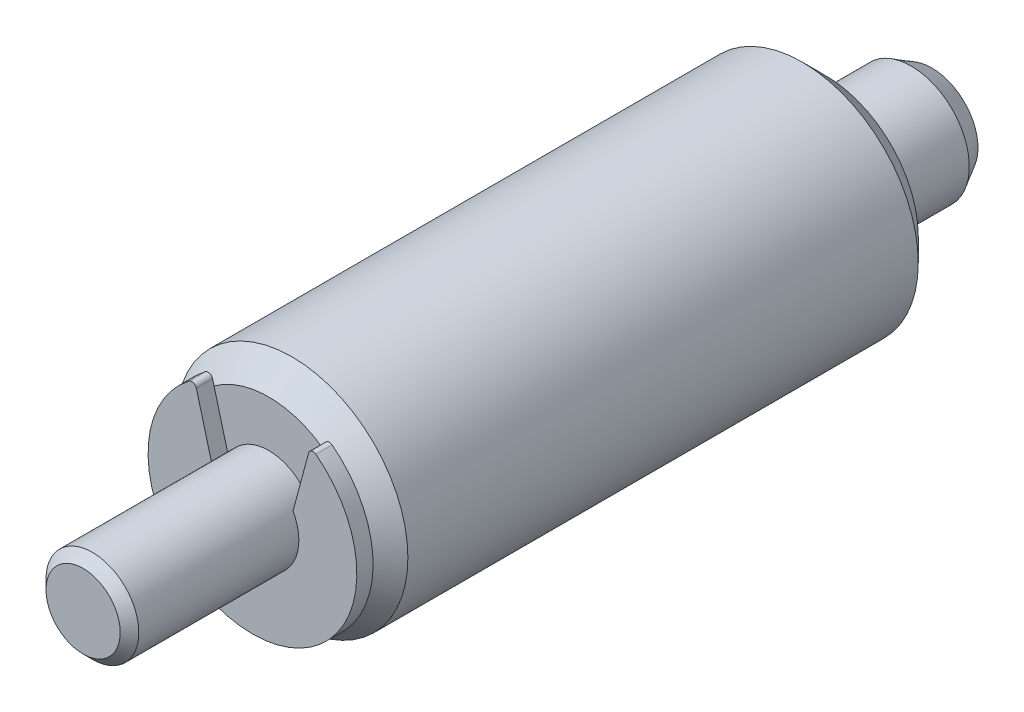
ISO-10303-21;
HEADER;
FILE_DESCRIPTION(('STEP AP214'),'2;1');
FILE_NAME('part.step','',(''),(''),'','','');
FILE_SCHEMA(('AUTOMOTIVE_DESIGN { 1 0 10303 214 1 1 1 1 }'));
ENDSEC;
DATA;
#1=APPLICATION_CONTEXT('core data for automotive mechanical design processes');
#2=APPLICATION_PROTOCOL_DEFINITION('international standard','automotive_design',2000,#1);
#3=PRODUCT_CONTEXT('',#1,'mechanical');
#4=PRODUCT('Part','Part','',(#3));
#5=PRODUCT_RELATED_PRODUCT_CATEGORY('part','',(#4));
#6=PRODUCT_DEFINITION_FORMATION('','',#4);
#7=PRODUCT_DEFINITION_CONTEXT('part definition',#1,'design');
#8=PRODUCT_DEFINITION('design','',#6,#7);
#9=PRODUCT_DEFINITION_SHAPE('','',#8);
#10=(LENGTH_UNIT() NAMED_UNIT(*) SI_UNIT(.MILLI.,.METRE.));
#11=(NAMED_UNIT(*) PLANE_ANGLE_UNIT() SI_UNIT($,.RADIAN.));
#12=(NAMED_UNIT(*) SI_UNIT($,.STERADIAN.) SOLID_ANGLE_UNIT());
#13=UNCERTAINTY_MEASURE_WITH_UNIT(LENGTH_MEASURE(1.E-05),#10,'distance_accuracy_value','');
#14=(GEOMETRIC_REPRESENTATION_CONTEXT(3) GLOBAL_UNCERTAINTY_ASSIGNED_CONTEXT((#13)) GLOBAL_UNIT_ASSIGNED_CONTEXT((#10,
#11,#12)) REPRESENTATION_CONTEXT('',''));
#15=CARTESIAN_POINT('',(0.,0.,0.));
#16=DIRECTION('',(0.,0.,1.));
#17=DIRECTION('',(1.,0.,0.));
#18=AXIS2_PLACEMENT_3D('',#15,#16,#17);
#19=CARTESIAN_POINT('',(4.048,-4.06192904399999,24.));
#20=DIRECTION('',(0.,0.,-1.));
#21=DIRECTION('',(-1.,0.,0.));
#22=AXIS2_PLACEMENT_3D('',#19,#20,#21);
#23=PLANE('',#22);
#24=DIRECTION('',(-0.258819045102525,-0.965925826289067,0.));
#25=VECTOR('',#24,1.);
#26=CARTESIAN_POINT('',(2.41953373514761,3.46697975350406,24.));
#27=LINE('',#26,#25);
#28=CARTESIAN_POINT('',(2.35659706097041,3.23209688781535,24.));
#29=VERTEX_POINT('',#28);
#30=CARTESIAN_POINT('',(1.75,0.968245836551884,24.));
#31=VERTEX_POINT('',#30);
#32=EDGE_CURVE('E176',#29,#31,#27,.T.);
#33=ORIENTED_EDGE('',*,*,#32,.F.);
#34=CARTESIAN_POINT('',(0.,0.,24.));
#35=DIRECTION('',(0.,0.,-1.));
#36=DIRECTION('',(-1.,0.,0.));
#37=AXIS2_PLACEMENT_3D('',#34,#35,#36);
#38=CIRCLE('',#37,4.);
#39=CARTESIAN_POINT('',(-2.35659706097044,3.23209688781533,24.));
#40=VERTEX_POINT('',#39);
#41=EDGE_CURVE('E179',#40,#29,#38,.T.);
#42=ORIENTED_EDGE('',*,*,#41,.F.);
#43=DIRECTION('',(-0.258819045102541,0.965925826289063,0.));
#44=VECTOR('',#43,1.);
#45=CARTESIAN_POINT('',(-2.41953373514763,3.46697975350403,24.));
#46=LINE('',#45,#44);
#47=CARTESIAN_POINT('',(-1.75,0.968245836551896,24.));
#48=VERTEX_POINT('',#47);
#49=EDGE_CURVE('E345',#48,#40,#46,.T.);
#50=ORIENTED_EDGE('',*,*,#49,.F.);
#51=CARTESIAN_POINT('',(0.,0.,24.));
#52=DIRECTION('',(0.,0.,-1.));
#53=DIRECTION('',(-1.,0.,0.));
#54=AXIS2_PLACEMENT_3D('',#51,#52,#53);
#55=CIRCLE('',#54,2.);
#56=EDGE_CURVE('E181',#31,#48,#55,.F.);
#57=ORIENTED_EDGE('',*,*,#56,.F.);
#58=EDGE_LOOP('',(#33,#42,#50,#57));
#59=FACE_BOUND('',#58,.T.);
#60=ADVANCED_FACE('F14',(#59),#23,.F.);
#61=CARTESIAN_POINT('',(0.,0.,31.6));
#62=DIRECTION('',(0.,0.,-1.));
#63=DIRECTION('',(-1.,0.,0.));
#64=AXIS2_PLACEMENT_3D('',#61,#62,#63);
#65=CYLINDRICAL_SURFACE('',#64,2.);
#66=CARTESIAN_POINT('',(0.,0.,31.6));
#67=DIRECTION('',(0.,0.,-1.));
#68=DIRECTION('',(-1.,0.,0.));
#69=AXIS2_PLACEMENT_3D('',#66,#67,#68);
#70=CIRCLE('',#69,2.);
#71=CARTESIAN_POINT('',(-2.,0.,31.5999999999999));
#72=VERTEX_POINT('',#71);
#73=EDGE_CURVE('E9',#72,#72,#70,.F.);
#74=ORIENTED_EDGE('',*,*,#73,.F.);
#75=EDGE_LOOP('',(#74));
#76=FACE_BOUND('',#75,.T.);
#77=DIRECTION('',(0.,0.,-1.));
#78=VECTOR('',#77,1.);
#79=CARTESIAN_POINT('',(1.75,0.968245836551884,24.7));
#80=LINE('',#79,#78);
#81=CARTESIAN_POINT('',(1.75,0.968245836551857,24.7));
#82=VERTEX_POINT('',#81);
#83=EDGE_CURVE('E31',#82,#31,#80,.T.);
#84=ORIENTED_EDGE('',*,*,#83,.T.);
#85=ORIENTED_EDGE('',*,*,#56,.T.);
#86=DIRECTION('',(0.,0.,-1.));
#87=VECTOR('',#86,1.);
#88=CARTESIAN_POINT('',(-1.75,0.968245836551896,24.7));
#89=LINE('',#88,#87);
#90=CARTESIAN_POINT('',(-1.75,0.968245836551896,24.7));
#91=VERTEX_POINT('',#90);
#92=EDGE_CURVE('E357',#91,#48,#89,.T.);
#93=ORIENTED_EDGE('',*,*,#92,.F.);
#94=CARTESIAN_POINT('',(0.,0.,24.7));
#95=DIRECTION('',(0.,0.,-1.));
#96=DIRECTION('',(1.,0.,0.));
#97=AXIS2_PLACEMENT_3D('',#94,#95,#96);
#98=CIRCLE('',#97,2.);
#99=EDGE_CURVE('E361',#82,#91,#98,.T.);
#100=ORIENTED_EDGE('',*,*,#99,.F.);
#101=EDGE_LOOP('',(#84,#85,#93,#100));
#102=FACE_BOUND('',#101,.T.);
#103=ADVANCED_FACE('F136',(#76,#102),#65,.T.);
#104=CARTESIAN_POINT('',(-3.83565179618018E-10,2.30995778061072E-10,1.52516888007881E-10));
#105=DIRECTION('',(-1.,0.,0.));
#106=DIRECTION('',(0.,0.,-1.));
#107=AXIS2_PLACEMENT_3D('',#104,#105,#106);
#108=SPHERICAL_SURFACE('',#107,5.);
#109=CARTESIAN_POINT('',(0.,0.,-4.58812253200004));
#110=DIRECTION('',(0.,0.,1.));
#111=DIRECTION('',(1.,0.,0.));
#112=AXIS2_PLACEMENT_3D('',#109,#110,#111);
#113=CIRCLE('',#112,1.987242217);
#114=CARTESIAN_POINT('',(-1.98723890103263,-0.00361754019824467,-4.58812254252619));
#115=VERTEX_POINT('',#114);
#116=CARTESIAN_POINT('',(1.98724059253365,-0.00361753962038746,-4.58812180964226));
#117=VERTEX_POINT('',#116);
#118=EDGE_CURVE('E199',#115,#117,#113,.T.);
#119=ORIENTED_EDGE('',*,*,#118,.F.);
#120=CARTESIAN_POINT('',(-1.98723887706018,0.,0.));
#121=DIRECTION('',(-1.,0.,0.));
#122=DIRECTION('',(0.,5.03464551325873E-11,1.));
#123=AXIS2_PLACEMENT_3D('',#120,#121,#122);
#124=CIRCLE('',#123,4.58812397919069);
#125=CARTESIAN_POINT('',(-1.98724138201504,-4.0759062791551E-10,-4.5881228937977));
#126=VERTEX_POINT('',#125);
#127=EDGE_CURVE('E51',#115,#126,#124,.F.);
#128=ORIENTED_EDGE('',*,*,#127,.T.);
#129=CARTESIAN_POINT('',(0.,0.,-4.58812253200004));
#130=DIRECTION('',(0.,0.,1.));
#131=DIRECTION('',(1.,0.,0.));
#132=AXIS2_PLACEMENT_3D('',#129,#130,#131);
#133=CIRCLE('',#132,1.987242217);
#134=CARTESIAN_POINT('',(1.9872422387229,-1.23498433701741E-09,-4.58812252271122));
#135=VERTEX_POINT('',#134);
#136=EDGE_CURVE('E18',#135,#126,#133,.T.);
#137=ORIENTED_EDGE('',*,*,#136,.F.);
#138=CARTESIAN_POINT('',(1.9872422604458,0.,0.));
#139=DIRECTION('',(-1.,0.,0.));
#140=DIRECTION('',(0.,5.03464712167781E-11,1.));
#141=AXIS2_PLACEMENT_3D('',#138,#139,#140);
#142=CIRCLE('',#141,4.58812251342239);
#143=EDGE_CURVE('E40',#135,#117,#142,.T.);
#144=ORIENTED_EDGE('',*,*,#143,.T.);
#145=EDGE_LOOP('',(#119,#128,#137,#144));
#146=FACE_BOUND('',#145,.T.);
#147=ADVANCED_FACE('F131',(#146),#108,.T.);
#148=CARTESIAN_POINT('',(0.,0.,-4.58812253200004));
#149=DIRECTION('',(0.,0.,1.));
#150=DIRECTION('',(1.,0.,0.));
#151=AXIS2_PLACEMENT_3D('',#148,#149,#150);
#152=CONICAL_SURFACE('',#151,1.987242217,0.523598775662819);
#153=ORIENTED_EDGE('',*,*,#136,.T.);
#154=ORIENTED_EDGE('',*,*,#127,.F.);
#155=ORIENTED_EDGE('',*,*,#118,.T.);
#156=ORIENTED_EDGE('',*,*,#143,.F.);
#157=EDGE_LOOP('',(#153,#154,#155,#156));
#158=FACE_BOUND('',#157,.T.);
#159=CARTESIAN_POINT('',(0.,0.,-3.7));
#160=DIRECTION('',(0.,0.,-1.));
#161=DIRECTION('',(-1.,0.,0.));
#162=AXIS2_PLACEMENT_3D('',#159,#160,#161);
#163=CIRCLE('',#162,2.5);
#164=CARTESIAN_POINT('',(-2.5,0.,-3.7));
#165=VERTEX_POINT('',#164);
#166=EDGE_CURVE('E198',#165,#165,#163,.F.);
#167=ORIENTED_EDGE('',*,*,#166,.F.);
#168=EDGE_LOOP('',(#167));
#169=FACE_BOUND('',#168,.T.);
#170=ADVANCED_FACE('F135',(#158,#169),#152,.T.);
#171=CARTESIAN_POINT('',(0.,0.,0.));
#172=DIRECTION('',(0.,0.,-1.));
#173=DIRECTION('',(-1.,0.,0.));
#174=AXIS2_PLACEMENT_3D('',#171,#172,#173);
#175=CYLINDRICAL_SURFACE('',#174,2.5);
#176=CARTESIAN_POINT('',(0.,0.,0.));
#177=DIRECTION('',(0.,0.,-1.));
#178=DIRECTION('',(-1.,0.,0.));
#179=AXIS2_PLACEMENT_3D('',#176,#177,#178);
#180=CIRCLE('',#179,2.5);
#181=CARTESIAN_POINT('',(-2.5,0.,0.));
#182=VERTEX_POINT('',#181);
#183=EDGE_CURVE('E196',#182,#182,#180,.F.);
#184=ORIENTED_EDGE('',*,*,#183,.F.);
#185=EDGE_LOOP('',(#184));
#186=FACE_BOUND('',#185,.T.);
#187=ORIENTED_EDGE('',*,*,#166,.T.);
#188=EDGE_LOOP('',(#187));
#189=FACE_BOUND('',#188,.T.);
#190=ADVANCED_FACE('F141',(#186,#189),#175,.T.);
#191=CARTESIAN_POINT('',(4.048,-4.06192904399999,0.));
#192=DIRECTION('',(0.,0.,-1.));
#193=DIRECTION('',(-1.,0.,0.));
#194=AXIS2_PLACEMENT_3D('',#191,#192,#193);
#195=PLANE('',#194);
#196=ORIENTED_EDGE('',*,*,#183,.T.);
#197=EDGE_LOOP('',(#196));
#198=FACE_BOUND('',#197,.T.);
#199=CARTESIAN_POINT('',(0.,0.,0.));
#200=DIRECTION('',(0.,0.,1.));
#201=DIRECTION('',(1.,0.,0.));
#202=AXIS2_PLACEMENT_3D('',#199,#200,#201);
#203=CIRCLE('',#202,4.0000000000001);
#204=CARTESIAN_POINT('',(4.0000000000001,0.,0.));
#205=VERTEX_POINT('',#204);
#206=EDGE_CURVE('E193',#205,#205,#203,.T.);
#207=ORIENTED_EDGE('',*,*,#206,.F.);
#208=EDGE_LOOP('',(#207));
#209=FACE_BOUND('',#208,.T.);
#210=ADVANCED_FACE('F144',(#198,#209),#195,.T.);
#211=CARTESIAN_POINT('',(0.,0.,0.));
#212=DIRECTION('',(0.,0.,1.));
#213=DIRECTION('',(1.,0.,0.));
#214=AXIS2_PLACEMENT_3D('',#211,#212,#213);
#215=CONICAL_SURFACE('',#214,4.,0.785398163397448);
#216=CARTESIAN_POINT('',(0.,0.,1.));
#217=DIRECTION('',(0.,0.,-1.));
#218=DIRECTION('',(-1.,0.,0.));
#219=AXIS2_PLACEMENT_3D('',#216,#217,#218);
#220=CIRCLE('',#219,5.);
#221=CARTESIAN_POINT('',(-5.,0.,1.));
#222=VERTEX_POINT('',#221);
#223=EDGE_CURVE('E190',#222,#222,#220,.F.);
#224=ORIENTED_EDGE('',*,*,#223,.F.);
#225=EDGE_LOOP('',(#224));
#226=FACE_BOUND('',#225,.T.);
#227=ORIENTED_EDGE('',*,*,#206,.T.);
#228=EDGE_LOOP('',(#227));
#229=FACE_BOUND('',#228,.T.);
#230=ADVANCED_FACE('F146',(#226,#229),#215,.T.);
#231=CARTESIAN_POINT('',(0.,0.,23.));
#232=DIRECTION('',(0.,0.,-1.));
#233=DIRECTION('',(-1.,0.,0.));
#234=AXIS2_PLACEMENT_3D('',#231,#232,#233);
#235=CYLINDRICAL_SURFACE('',#234,5.);
#236=ORIENTED_EDGE('',*,*,#223,.T.);
#237=EDGE_LOOP('',(#236));
#238=FACE_BOUND('',#237,.T.);
#239=CARTESIAN_POINT('',(0.,0.,23.));
#240=DIRECTION('',(0.,0.,-1.));
#241=DIRECTION('',(-1.,0.,0.));
#242=AXIS2_PLACEMENT_3D('',#239,#240,#241);
#243=CIRCLE('',#242,5.);
#244=CARTESIAN_POINT('',(-5.,0.,22.9999999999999));
#245=VERTEX_POINT('',#244);
#246=EDGE_CURVE('E186',#245,#245,#243,.F.);
#247=ORIENTED_EDGE('',*,*,#246,.F.);
#248=EDGE_LOOP('',(#247));
#249=FACE_BOUND('',#248,.T.);
#250=ADVANCED_FACE('F149',(#238,#249),#235,.T.);
#251=CARTESIAN_POINT('',(0.,0.,24.));
#252=DIRECTION('',(0.,0.,-1.));
#253=DIRECTION('',(-1.,0.,0.));
#254=AXIS2_PLACEMENT_3D('',#251,#252,#253);
#255=CONICAL_SURFACE('',#254,4.,0.785398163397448);
#256=ORIENTED_EDGE('',*,*,#246,.T.);
#257=EDGE_LOOP('',(#256));
#258=FACE_BOUND('',#257,.T.);
#259=ORIENTED_EDGE('',*,*,#41,.T.);
#260=CARTESIAN_POINT('',(0.,0.,24.));
#261=DIRECTION('',(0.,0.,1.));
#262=DIRECTION('',(1.,0.,0.));
#263=AXIS2_PLACEMENT_3D('',#260,#261,#262);
#264=CIRCLE('',#263,4.);
#265=EDGE_CURVE('E59',#40,#29,#264,.T.);
#266=ORIENTED_EDGE('',*,*,#265,.F.);
#267=EDGE_LOOP('',(#259,#266));
#268=FACE_BOUND('',#267,.T.);
#269=ADVANCED_FACE('F153',(#258,#268),#255,.T.);
#270=CARTESIAN_POINT('',(1.6192,-1.62477161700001,32.));
#271=DIRECTION('',(0.,0.,-1.));
#272=DIRECTION('',(-1.,0.,0.));
#273=AXIS2_PLACEMENT_3D('',#270,#271,#272);
#274=PLANE('',#273);
#275=CARTESIAN_POINT('',(0.,0.,32.));
#276=DIRECTION('',(0.,0.,-1.));
#277=DIRECTION('',(0.,-1.,0.));
#278=AXIS2_PLACEMENT_3D('',#275,#276,#277);
#279=CIRCLE('',#278,1.6);
#280=CARTESIAN_POINT('',(0.,-1.6,32.));
#281=VERTEX_POINT('',#280);
#282=EDGE_CURVE('E23',#281,#281,#279,.T.);
#283=ORIENTED_EDGE('',*,*,#282,.F.);
#284=EDGE_LOOP('',(#283));
#285=FACE_BOUND('',#284,.T.);
#286=ADVANCED_FACE('F16',(#285),#274,.F.);
#287=CARTESIAN_POINT('',(0.,0.,32.));
#288=DIRECTION('',(0.,0.,-1.));
#289=DIRECTION('',(0.,-1.,0.));
#290=AXIS2_PLACEMENT_3D('',#287,#288,#289);
#291=CONICAL_SURFACE('',#290,1.6,0.785398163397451);
#292=ORIENTED_EDGE('',*,*,#73,.T.);
#293=EDGE_LOOP('',(#292));
#294=FACE_BOUND('',#293,.T.);
#295=ORIENTED_EDGE('',*,*,#282,.T.);
#296=EDGE_LOOP('',(#295));
#297=FACE_BOUND('',#296,.T.);
#298=ADVANCED_FACE('F161',(#294,#297),#291,.T.);
#299=CARTESIAN_POINT('',(0.,0.,24.));
#300=DIRECTION('',(0.,0.,1.));
#301=DIRECTION('',(1.,0.,0.));
#302=AXIS2_PLACEMENT_3D('',#299,#300,#301);
#303=PLANE('',#302);
#304=CARTESIAN_POINT('',(-2.41953373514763,3.46697975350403,24.));
#305=VERTEX_POINT('',#304);
#306=EDGE_CURVE('E353',#40,#305,#46,.T.);
#307=ORIENTED_EDGE('',*,*,#306,.F.);
#308=ORIENTED_EDGE('',*,*,#265,.T.);
#309=CARTESIAN_POINT('',(2.4195337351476,3.46697975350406,24.));
#310=VERTEX_POINT('',#309);
#311=EDGE_CURVE('E182',#310,#29,#27,.T.);
#312=ORIENTED_EDGE('',*,*,#311,.F.);
#313=CARTESIAN_POINT('',(2.61271890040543,3.41521594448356,24.));
#314=DIRECTION('',(0.,0.,1.));
#315=DIRECTION('',(1.,0.,0.));
#316=AXIS2_PLACEMENT_3D('',#313,#314,#315);
#317=CIRCLE('',#316,0.200000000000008);
#318=CARTESIAN_POINT('',(2.73424070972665,3.57406319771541,24.));
#319=VERTEX_POINT('',#318);
#320=EDGE_CURVE('E183',#319,#310,#317,.T.);
#321=ORIENTED_EDGE('',*,*,#320,.F.);
#322=CARTESIAN_POINT('',(0.,0.,24.));
#323=DIRECTION('',(0.,0.,1.));
#324=DIRECTION('',(1.,0.,0.));
#325=AXIS2_PLACEMENT_3D('',#322,#323,#324);
#326=CIRCLE('',#325,4.49999999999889);
#327=CARTESIAN_POINT('',(-2.73424070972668,3.57406319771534,24.));
#328=VERTEX_POINT('',#327);
#329=EDGE_CURVE('E120',#328,#319,#326,.T.);
#330=ORIENTED_EDGE('',*,*,#329,.F.);
#331=CARTESIAN_POINT('',(-2.61271890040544,3.41521594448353,24.));
#332=DIRECTION('',(0.,0.,1.));
#333=DIRECTION('',(1.,0.,0.));
#334=AXIS2_PLACEMENT_3D('',#331,#332,#333);
#335=CIRCLE('',#334,0.199999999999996);
#336=EDGE_CURVE('E116',#305,#328,#335,.T.);
#337=ORIENTED_EDGE('',*,*,#336,.F.);
#338=EDGE_LOOP('',(#307,#308,#312,#321,#330,#337));
#339=FACE_BOUND('',#338,.T.);
#340=ADVANCED_FACE('F137',(#339),#303,.F.);
#341=CARTESIAN_POINT('',(0.,0.,24.7));
#342=DIRECTION('',(0.,0.,-1.));
#343=DIRECTION('',(-1.,0.,0.));
#344=AXIS2_PLACEMENT_3D('',#341,#342,#343);
#345=CYLINDRICAL_SURFACE('',#344,4.49999999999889);
#346=ORIENTED_EDGE('',*,*,#329,.T.);
#347=DIRECTION('',(0.,0.,-1.));
#348=VECTOR('',#347,1.);
#349=CARTESIAN_POINT('',(2.73424070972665,3.57406319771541,24.7));
#350=LINE('',#349,#348);
#351=CARTESIAN_POINT('',(2.73424070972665,3.57406319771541,24.7));
#352=VERTEX_POINT('',#351);
#353=EDGE_CURVE('E101',#352,#319,#350,.T.);
#354=ORIENTED_EDGE('',*,*,#353,.F.);
#355=CARTESIAN_POINT('',(0.,0.,24.7));
#356=DIRECTION('',(0.,0.,1.));
#357=DIRECTION('',(1.,0.,0.));
#358=AXIS2_PLACEMENT_3D('',#355,#356,#357);
#359=CIRCLE('',#358,4.49999999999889);
#360=CARTESIAN_POINT('',(-2.73424070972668,3.57406319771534,24.7));
#361=VERTEX_POINT('',#360);
#362=EDGE_CURVE('E107',#361,#352,#359,.T.);
#363=ORIENTED_EDGE('',*,*,#362,.F.);
#364=DIRECTION('',(0.,0.,-1.));
#365=VECTOR('',#364,1.);
#366=CARTESIAN_POINT('',(-2.73424070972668,3.57406319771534,24.7));
#367=LINE('',#366,#365);
#368=EDGE_CURVE('E342',#361,#328,#367,.T.);
#369=ORIENTED_EDGE('',*,*,#368,.T.);
#370=EDGE_LOOP('',(#346,#354,#363,#369));
#371=FACE_BOUND('',#370,.T.);
#372=ADVANCED_FACE('F118',(#371),#345,.T.);
#373=CARTESIAN_POINT('',(2.61271890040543,3.41521594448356,24.7));
#374=DIRECTION('',(0.,0.,-1.));
#375=DIRECTION('',(-1.,0.,0.));
#376=AXIS2_PLACEMENT_3D('',#373,#374,#375);
#377=CYLINDRICAL_SURFACE('',#376,0.200000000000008);
#378=ORIENTED_EDGE('',*,*,#320,.T.);
#379=DIRECTION('',(0.,0.,-1.));
#380=VECTOR('',#379,1.);
#381=CARTESIAN_POINT('',(2.4195337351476,3.46697975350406,24.7));
#382=LINE('',#381,#380);
#383=CARTESIAN_POINT('',(2.4195337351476,3.46697975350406,24.7));
#384=VERTEX_POINT('',#383);
#385=EDGE_CURVE('E104',#384,#310,#382,.T.);
#386=ORIENTED_EDGE('',*,*,#385,.F.);
#387=CARTESIAN_POINT('',(2.61271890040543,3.41521594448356,24.7));
#388=DIRECTION('',(0.,0.,1.));
#389=DIRECTION('',(1.,0.,0.));
#390=AXIS2_PLACEMENT_3D('',#387,#388,#389);
#391=CIRCLE('',#390,0.200000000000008);
#392=EDGE_CURVE('E97',#352,#384,#391,.T.);
#393=ORIENTED_EDGE('',*,*,#392,.F.);
#394=ORIENTED_EDGE('',*,*,#353,.T.);
#395=EDGE_LOOP('',(#378,#386,#393,#394));
#396=FACE_BOUND('',#395,.T.);
#397=ADVANCED_FACE('F99',(#396),#377,.T.);
#398=CARTESIAN_POINT('',(2.41953373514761,3.46697975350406,24.7));
#399=DIRECTION('',(0.965925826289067,-0.258819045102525,0.));
#400=DIRECTION('',(0.258819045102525,0.965925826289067,0.));
#401=AXIS2_PLACEMENT_3D('',#398,#399,#400);
#402=PLANE('',#401);
#403=ORIENTED_EDGE('',*,*,#311,.T.);
#404=ORIENTED_EDGE('',*,*,#32,.T.);
#405=ORIENTED_EDGE('',*,*,#83,.F.);
#406=DIRECTION('',(-0.258819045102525,-0.965925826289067,0.));
#407=VECTOR('',#406,1.);
#408=CARTESIAN_POINT('',(2.41953373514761,3.46697975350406,24.7));
#409=LINE('',#408,#407);
#410=EDGE_CURVE('E106',#384,#82,#409,.T.);
#411=ORIENTED_EDGE('',*,*,#410,.F.);
#412=ORIENTED_EDGE('',*,*,#385,.T.);
#413=EDGE_LOOP('',(#403,#404,#405,#411,#412));
#414=FACE_BOUND('',#413,.T.);
#415=ADVANCED_FACE('F247',(#414),#402,.F.);
#416=CARTESIAN_POINT('',(-2.41953373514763,3.46697975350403,24.7));
#417=DIRECTION('',(-0.965925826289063,-0.258819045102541,0.));
#418=DIRECTION('',(0.258819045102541,-0.965925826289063,0.));
#419=AXIS2_PLACEMENT_3D('',#416,#417,#418);
#420=PLANE('',#419);
#421=ORIENTED_EDGE('',*,*,#49,.T.);
#422=ORIENTED_EDGE('',*,*,#306,.T.);
#423=DIRECTION('',(0.,0.,-1.));
#424=VECTOR('',#423,1.);
#425=CARTESIAN_POINT('',(-2.41953373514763,3.46697975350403,24.7));
#426=LINE('',#425,#424);
#427=CARTESIAN_POINT('',(-2.41953373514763,3.46697975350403,24.7));
#428=VERTEX_POINT('',#427);
#429=EDGE_CURVE('E344',#428,#305,#426,.T.);
#430=ORIENTED_EDGE('',*,*,#429,.F.);
#431=DIRECTION('',(-0.258819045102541,0.965925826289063,0.));
#432=VECTOR('',#431,1.);
#433=CARTESIAN_POINT('',(-2.41953373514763,3.46697975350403,24.7));
#434=LINE('',#433,#432);
#435=EDGE_CURVE('E363',#91,#428,#434,.T.);
#436=ORIENTED_EDGE('',*,*,#435,.F.);
#437=ORIENTED_EDGE('',*,*,#92,.T.);
#438=EDGE_LOOP('',(#421,#422,#430,#436,#437));
#439=FACE_BOUND('',#438,.T.);
#440=ADVANCED_FACE('F254',(#439),#420,.F.);
#441=CARTESIAN_POINT('',(-2.61271890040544,3.41521594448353,24.7));
#442=DIRECTION('',(0.,0.,-1.));
#443=DIRECTION('',(-1.,0.,0.));
#444=AXIS2_PLACEMENT_3D('',#441,#442,#443);
#445=CYLINDRICAL_SURFACE('',#444,0.199999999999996);
#446=ORIENTED_EDGE('',*,*,#336,.T.);
#447=ORIENTED_EDGE('',*,*,#368,.F.);
#448=CARTESIAN_POINT('',(-2.61271890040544,3.41521594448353,24.7));
#449=DIRECTION('',(0.,0.,1.));
#450=DIRECTION('',(1.,0.,0.));
#451=AXIS2_PLACEMENT_3D('',#448,#449,#450);
#452=CIRCLE('',#451,0.199999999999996);
#453=EDGE_CURVE('E112',#428,#361,#452,.T.);
#454=ORIENTED_EDGE('',*,*,#453,.F.);
#455=ORIENTED_EDGE('',*,*,#429,.T.);
#456=EDGE_LOOP('',(#446,#447,#454,#455));
#457=FACE_BOUND('',#456,.T.);
#458=ADVANCED_FACE('F262',(#457),#445,.T.);
#459=CARTESIAN_POINT('',(0.,0.,24.7));
#460=DIRECTION('',(0.,0.,1.));
#461=DIRECTION('',(1.,0.,0.));
#462=AXIS2_PLACEMENT_3D('',#459,#460,#461);
#463=PLANE('',#462);
#464=ORIENTED_EDGE('',*,*,#362,.T.);
#465=ORIENTED_EDGE('',*,*,#392,.T.);
#466=ORIENTED_EDGE('',*,*,#410,.T.);
#467=ORIENTED_EDGE('',*,*,#99,.T.);
#468=ORIENTED_EDGE('',*,*,#435,.T.);
#469=ORIENTED_EDGE('',*,*,#453,.T.);
#470=EDGE_LOOP('',(#464,#465,#466,#467,#468,#469));
#471=FACE_BOUND('',#470,.T.);
#472=ADVANCED_FACE('F110',(#471),#463,.T.);
#473=CLOSED_SHELL('',(#60,#103,#147,#170,#190,#210,#230,#250,#269,#286,#298,#340,#372,#397,#415,
#440,#458,#472));
#474=MANIFOLD_SOLID_BREP('B1',#473);
#475=ADVANCED_BREP_SHAPE_REPRESENTATION('',(#18,#474),#14);
#476=SHAPE_DEFINITION_REPRESENTATION(#9,#475);
ENDSEC;
END-ISO-10303-21;
